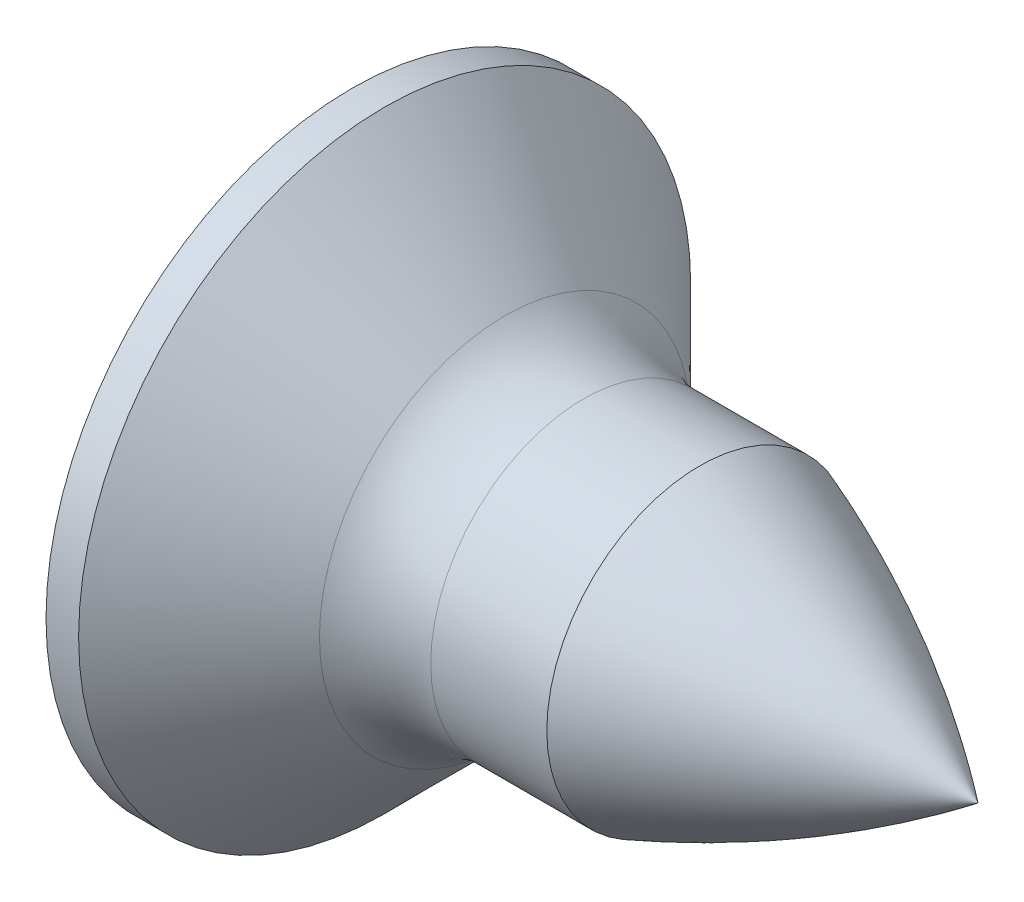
from build123d import *

# Parameters (mm, degrees)
CROSSRECESS_DEPTH = 0.95
DRAFT1_ANGLE      = 30


with BuildPart() as part:
    # Sketch1 → Base (revolve)
    with BuildSketch(Plane.XY, mode=Mode.PRIVATE) as base_sk:
        with BuildLine():
            Line((4.5, 0), (4.5, 1.1))
            Line((4.5, 1.1), (1.665685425, 1.1))
            ThreePointArc((1.665685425, 1.1), (1.359538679, 1.160896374), (1.1, 1.334314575))
            Line((1.1, 1.334314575), (0.234314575, 2.2))
            Line((0.234314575, 2.2), (0, 2.2))
            Line((0, 2.2), (0, 0))
            Line((0, 0), (4.5, 0))
        make_face()
    revolve(base_sk.sketch.rotate(Axis((-96.385195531, 0, 0), (1, 0, 0)), 90), axis=Axis((-96.385195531, 0, 0), (1, 0, 0)))

    # Sketch2 → CrossRecess (cut)
    with BuildSketch(Plane(origin=(0, -0.762930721, -8.381824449), x_dir=(0, 0, 1), z_dir=(-1, 0, 0))):
        Polygon((8.581824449, 1.762930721), (8.181824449, 1.762930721), (8.181824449, 0.962930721), (7.381824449, 0.962930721), (7.381824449, 0.562930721), (8.181824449, 0.562930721), (8.181824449, -0.237069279), (8.581824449, -0.237069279), (8.581824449, 0.562930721), (9.381824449, 0.562930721), (9.381824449, 0.962930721), (8.581824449, 0.962930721), align=None)
    extrude(amount=-CROSSRECESS_DEPTH, mode=Mode.SUBTRACT)

    # Draft1
    draft1_faces = [part.faces().sort_by_distance(p)[0] for p in [
        (0.475, -1, 0),
        (0.475, 0, 1),
        (0.475, 0, -1),
        (0.475, 1, 0),
    ]]
    draft(draft1_faces, Plane(origin=(0, 2.2, 0), x_dir=(0, 0, -1), z_dir=(-1, 0, 0)), DRAFT1_ANGLE)

    # Sketch5 → Cut-Revolve6 (revolve, cut)
    with BuildSketch(Plane(origin=(0, 0, 0), x_dir=(1, 0, 0), z_dir=(0, 1, 0))):
        with BuildLine():
            Line((4.5, 0), (5, 0))
            Line((5, 0), (5, -1.1))
            Line((5, -1.1), (4.5, -1.1))
            Line((4.5, -1.1), (2.5, -1.1))
            ThreePointArc((2.5, -1.1), (3.53943286, -0.621696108), (4.5, 0))
        make_face()
    revolve(axis=Axis((34.740663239, 0, 0), (-1, 0, 0)), mode=Mode.SUBTRACT)


solid = part.part
